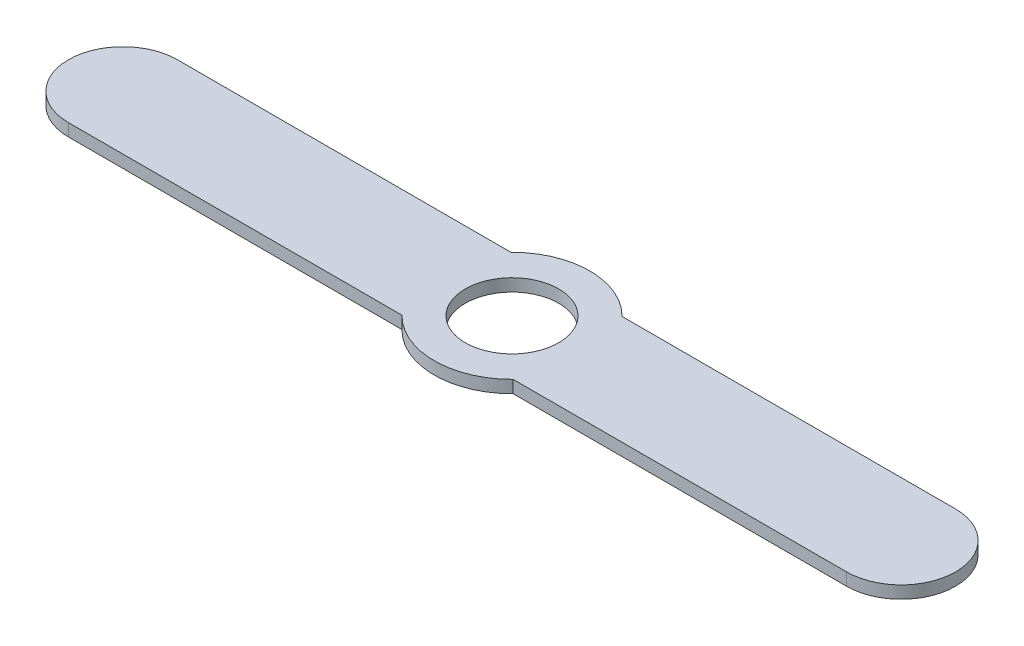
ISO-10303-21;
HEADER;
FILE_DESCRIPTION(('STEP AP214'),'2;1');
FILE_NAME('part.step','',(''),(''),'','','');
FILE_SCHEMA(('AUTOMOTIVE_DESIGN { 1 0 10303 214 1 1 1 1 }'));
ENDSEC;
DATA;
#1=APPLICATION_CONTEXT('core data for automotive mechanical design processes');
#2=APPLICATION_PROTOCOL_DEFINITION('international standard','automotive_design',2000,#1);
#3=PRODUCT_CONTEXT('',#1,'mechanical');
#4=PRODUCT('Part','Part','',(#3));
#5=PRODUCT_RELATED_PRODUCT_CATEGORY('part','',(#4));
#6=PRODUCT_DEFINITION_FORMATION('','',#4);
#7=PRODUCT_DEFINITION_CONTEXT('part definition',#1,'design');
#8=PRODUCT_DEFINITION('design','',#6,#7);
#9=PRODUCT_DEFINITION_SHAPE('','',#8);
#10=(LENGTH_UNIT() NAMED_UNIT(*) SI_UNIT(.MILLI.,.METRE.));
#11=(NAMED_UNIT(*) PLANE_ANGLE_UNIT() SI_UNIT($,.RADIAN.));
#12=(NAMED_UNIT(*) SI_UNIT($,.STERADIAN.) SOLID_ANGLE_UNIT());
#13=UNCERTAINTY_MEASURE_WITH_UNIT(LENGTH_MEASURE(1.E-05),#10,'distance_accuracy_value','');
#14=(GEOMETRIC_REPRESENTATION_CONTEXT(3) GLOBAL_UNCERTAINTY_ASSIGNED_CONTEXT((#13)) GLOBAL_UNIT_ASSIGNED_CONTEXT((#10,
#11,#12)) REPRESENTATION_CONTEXT('',''));
#15=CARTESIAN_POINT('',(0.,0.,0.));
#16=DIRECTION('',(0.,0.,1.));
#17=DIRECTION('',(1.,0.,0.));
#18=AXIS2_PLACEMENT_3D('',#15,#16,#17);
#19=CARTESIAN_POINT('',(0.,0.254,0.));
#20=DIRECTION('',(0.,1.,0.));
#21=DIRECTION('',(0.,0.,1.));
#22=AXIS2_PLACEMENT_3D('',#19,#20,#21);
#23=PLANE('',#22);
#24=CARTESIAN_POINT('',(0.,0.254,0.));
#25=DIRECTION('',(0.,1.,0.));
#26=DIRECTION('',(0.,0.,1.));
#27=AXIS2_PLACEMENT_3D('',#24,#25,#26);
#28=CIRCLE('',#27,1.905);
#29=CARTESIAN_POINT('',(0.,0.254,1.905));
#30=VERTEX_POINT('',#29);
#31=EDGE_CURVE('E155',#30,#30,#28,.T.);
#32=ORIENTED_EDGE('',*,*,#31,.T.);
#33=EDGE_LOOP('',(#32));
#34=FACE_BOUND('',#33,.T.);
#35=CARTESIAN_POINT('',(0.,0.254,0.));
#36=DIRECTION('',(0.,1.,0.));
#37=DIRECTION('',(0.,0.,1.));
#38=AXIS2_PLACEMENT_3D('',#35,#36,#37);
#39=CIRCLE('',#38,3.175);
#40=CARTESIAN_POINT('',(-2.26740352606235,0.254,2.2225));
#41=VERTEX_POINT('',#40);
#42=CARTESIAN_POINT('',(2.26740352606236,0.254,2.2225));
#43=VERTEX_POINT('',#42);
#44=EDGE_CURVE('E178',#41,#43,#39,.T.);
#45=ORIENTED_EDGE('',*,*,#44,.F.);
#46=DIRECTION('',(1.,0.,0.));
#47=VECTOR('',#46,1.);
#48=CARTESIAN_POINT('',(0.,0.254,2.2225));
#49=LINE('',#48,#47);
#50=CARTESIAN_POINT('',(-15.875,0.254,2.2225));
#51=VERTEX_POINT('',#50);
#52=EDGE_CURVE('E176',#51,#41,#49,.T.);
#53=ORIENTED_EDGE('',*,*,#52,.F.);
#54=CARTESIAN_POINT('',(-15.875,0.254,0.));
#55=DIRECTION('',(0.,1.,0.));
#56=DIRECTION('',(0.,0.,1.));
#57=AXIS2_PLACEMENT_3D('',#54,#55,#56);
#58=CIRCLE('',#57,2.2225);
#59=CARTESIAN_POINT('',(-15.875,0.254,-2.2225));
#60=VERTEX_POINT('',#59);
#61=EDGE_CURVE('E146',#60,#51,#58,.T.);
#62=ORIENTED_EDGE('',*,*,#61,.F.);
#63=DIRECTION('',(1.,0.,0.));
#64=VECTOR('',#63,1.);
#65=CARTESIAN_POINT('',(0.,0.254,-2.2225));
#66=LINE('',#65,#64);
#67=CARTESIAN_POINT('',(-2.26740352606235,0.254,-2.2225));
#68=VERTEX_POINT('',#67);
#69=EDGE_CURVE('E142',#60,#68,#66,.T.);
#70=ORIENTED_EDGE('',*,*,#69,.T.);
#71=CARTESIAN_POINT('',(0.,0.254,0.));
#72=DIRECTION('',(0.,1.,0.));
#73=DIRECTION('',(0.,0.,1.));
#74=AXIS2_PLACEMENT_3D('',#71,#72,#73);
#75=CIRCLE('',#74,3.175);
#76=CARTESIAN_POINT('',(2.26740352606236,0.254,-2.2225));
#77=VERTEX_POINT('',#76);
#78=EDGE_CURVE('E154',#77,#68,#75,.T.);
#79=ORIENTED_EDGE('',*,*,#78,.F.);
#80=CARTESIAN_POINT('',(15.875,0.254,-2.2225));
#81=VERTEX_POINT('',#80);
#82=EDGE_CURVE('E186',#77,#81,#66,.T.);
#83=ORIENTED_EDGE('',*,*,#82,.T.);
#84=CARTESIAN_POINT('',(15.875,0.254,0.));
#85=DIRECTION('',(0.,1.,0.));
#86=DIRECTION('',(0.,0.,1.));
#87=AXIS2_PLACEMENT_3D('',#84,#85,#86);
#88=CIRCLE('',#87,2.2225);
#89=CARTESIAN_POINT('',(15.875,0.254,2.2225));
#90=VERTEX_POINT('',#89);
#91=EDGE_CURVE('E183',#90,#81,#88,.T.);
#92=ORIENTED_EDGE('',*,*,#91,.F.);
#93=DIRECTION('',(1.,0.,0.));
#94=VECTOR('',#93,1.);
#95=CARTESIAN_POINT('',(0.,0.254,2.2225));
#96=LINE('',#95,#94);
#97=EDGE_CURVE('E181',#43,#90,#96,.T.);
#98=ORIENTED_EDGE('',*,*,#97,.F.);
#99=EDGE_LOOP('',(#45,#53,#62,#70,#79,#83,#92,#98));
#100=FACE_BOUND('',#99,.T.);
#101=ADVANCED_FACE('F59',(#34,#100),#23,.F.);
#102=CARTESIAN_POINT('',(0.,0.762,0.));
#103=DIRECTION('',(0.,-1.,0.));
#104=DIRECTION('',(0.,0.,-1.));
#105=AXIS2_PLACEMENT_3D('',#102,#103,#104);
#106=CYLINDRICAL_SURFACE('',#105,3.175);
#107=ORIENTED_EDGE('',*,*,#44,.T.);
#108=DIRECTION('',(0.,-1.,0.));
#109=VECTOR('',#108,1.);
#110=CARTESIAN_POINT('',(2.26740352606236,0.762,2.2225));
#111=LINE('',#110,#109);
#112=CARTESIAN_POINT('',(2.26740352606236,0.762,2.2225));
#113=VERTEX_POINT('',#112);
#114=EDGE_CURVE('E148',#113,#43,#111,.T.);
#115=ORIENTED_EDGE('',*,*,#114,.F.);
#116=CARTESIAN_POINT('',(0.,0.762,0.));
#117=DIRECTION('',(0.,1.,0.));
#118=DIRECTION('',(0.,0.,1.));
#119=AXIS2_PLACEMENT_3D('',#116,#117,#118);
#120=CIRCLE('',#119,3.175);
#121=CARTESIAN_POINT('',(-2.26740352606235,0.762,2.2225));
#122=VERTEX_POINT('',#121);
#123=EDGE_CURVE('E132',#122,#113,#120,.T.);
#124=ORIENTED_EDGE('',*,*,#123,.F.);
#125=DIRECTION('',(0.,-1.,0.));
#126=VECTOR('',#125,1.);
#127=CARTESIAN_POINT('',(-2.26740352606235,0.762,2.2225));
#128=LINE('',#127,#126);
#129=EDGE_CURVE('E128',#122,#41,#128,.T.);
#130=ORIENTED_EDGE('',*,*,#129,.T.);
#131=EDGE_LOOP('',(#107,#115,#124,#130));
#132=FACE_BOUND('',#131,.T.);
#133=ADVANCED_FACE('F201',(#132),#106,.T.);
#134=CARTESIAN_POINT('',(0.,0.762,0.));
#135=DIRECTION('',(0.,1.,0.));
#136=DIRECTION('',(0.,0.,1.));
#137=AXIS2_PLACEMENT_3D('',#134,#135,#136);
#138=PLANE('',#137);
#139=CARTESIAN_POINT('',(0.,0.762,0.));
#140=DIRECTION('',(0.,1.,0.));
#141=DIRECTION('',(0.,0.,1.));
#142=AXIS2_PLACEMENT_3D('',#139,#140,#141);
#143=CIRCLE('',#142,1.905);
#144=CARTESIAN_POINT('',(0.,0.762,1.905));
#145=VERTEX_POINT('',#144);
#146=EDGE_CURVE('E159',#145,#145,#143,.T.);
#147=ORIENTED_EDGE('',*,*,#146,.F.);
#148=EDGE_LOOP('',(#147));
#149=FACE_BOUND('',#148,.T.);
#150=DIRECTION('',(1.,0.,0.));
#151=VECTOR('',#150,1.);
#152=CARTESIAN_POINT('',(0.,0.762,-2.2225));
#153=LINE('',#152,#151);
#154=CARTESIAN_POINT('',(2.26740352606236,0.762,-2.2225));
#155=VERTEX_POINT('',#154);
#156=CARTESIAN_POINT('',(15.875,0.762,-2.2225));
#157=VERTEX_POINT('',#156);
#158=EDGE_CURVE('E172',#155,#157,#153,.T.);
#159=ORIENTED_EDGE('',*,*,#158,.F.);
#160=CARTESIAN_POINT('',(0.,0.762,0.));
#161=DIRECTION('',(0.,1.,0.));
#162=DIRECTION('',(0.,0.,1.));
#163=AXIS2_PLACEMENT_3D('',#160,#161,#162);
#164=CIRCLE('',#163,3.175);
#165=CARTESIAN_POINT('',(-2.26740352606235,0.762,-2.2225));
#166=VERTEX_POINT('',#165);
#167=EDGE_CURVE('E152',#155,#166,#164,.T.);
#168=ORIENTED_EDGE('',*,*,#167,.T.);
#169=CARTESIAN_POINT('',(-15.875,0.762,-2.2225));
#170=VERTEX_POINT('',#169);
#171=EDGE_CURVE('E140',#170,#166,#153,.T.);
#172=ORIENTED_EDGE('',*,*,#171,.F.);
#173=CARTESIAN_POINT('',(-15.875,0.762,0.));
#174=DIRECTION('',(0.,1.,0.));
#175=DIRECTION('',(0.,0.,1.));
#176=AXIS2_PLACEMENT_3D('',#173,#174,#175);
#177=CIRCLE('',#176,2.2225);
#178=CARTESIAN_POINT('',(-15.875,0.762,2.2225));
#179=VERTEX_POINT('',#178);
#180=EDGE_CURVE('E133',#170,#179,#177,.T.);
#181=ORIENTED_EDGE('',*,*,#180,.T.);
#182=DIRECTION('',(1.,0.,0.));
#183=VECTOR('',#182,1.);
#184=CARTESIAN_POINT('',(0.,0.762,2.2225));
#185=LINE('',#184,#183);
#186=EDGE_CURVE('E121',#179,#122,#185,.T.);
#187=ORIENTED_EDGE('',*,*,#186,.T.);
#188=ORIENTED_EDGE('',*,*,#123,.T.);
#189=DIRECTION('',(1.,0.,0.));
#190=VECTOR('',#189,1.);
#191=CARTESIAN_POINT('',(0.,0.762,2.2225));
#192=LINE('',#191,#190);
#193=CARTESIAN_POINT('',(15.875,0.762,2.2225));
#194=VERTEX_POINT('',#193);
#195=EDGE_CURVE('E167',#113,#194,#192,.T.);
#196=ORIENTED_EDGE('',*,*,#195,.T.);
#197=CARTESIAN_POINT('',(15.875,0.762,0.));
#198=DIRECTION('',(0.,1.,0.));
#199=DIRECTION('',(0.,0.,1.));
#200=AXIS2_PLACEMENT_3D('',#197,#198,#199);
#201=CIRCLE('',#200,2.2225);
#202=EDGE_CURVE('E169',#194,#157,#201,.T.);
#203=ORIENTED_EDGE('',*,*,#202,.T.);
#204=EDGE_LOOP('',(#159,#168,#172,#181,#187,#188,#196,#203));
#205=FACE_BOUND('',#204,.T.);
#206=ADVANCED_FACE('F138',(#149,#205),#138,.T.);
#207=CARTESIAN_POINT('',(0.,0.762,2.2225));
#208=DIRECTION('',(0.,0.,-1.));
#209=DIRECTION('',(-1.,0.,0.));
#210=AXIS2_PLACEMENT_3D('',#207,#208,#209);
#211=PLANE('',#210);
#212=ORIENTED_EDGE('',*,*,#97,.T.);
#213=DIRECTION('',(0.,-1.,0.));
#214=VECTOR('',#213,1.);
#215=CARTESIAN_POINT('',(15.875,0.762,2.2225));
#216=LINE('',#215,#214);
#217=EDGE_CURVE('E192',#194,#90,#216,.T.);
#218=ORIENTED_EDGE('',*,*,#217,.F.);
#219=ORIENTED_EDGE('',*,*,#195,.F.);
#220=ORIENTED_EDGE('',*,*,#114,.T.);
#221=EDGE_LOOP('',(#212,#218,#219,#220));
#222=FACE_BOUND('',#221,.T.);
#223=ADVANCED_FACE('F196',(#222),#211,.F.);
#224=CARTESIAN_POINT('',(15.875,0.762,0.));
#225=DIRECTION('',(0.,-1.,0.));
#226=DIRECTION('',(0.,0.,-1.));
#227=AXIS2_PLACEMENT_3D('',#224,#225,#226);
#228=CYLINDRICAL_SURFACE('',#227,2.2225);
#229=ORIENTED_EDGE('',*,*,#91,.T.);
#230=DIRECTION('',(0.,-1.,0.));
#231=VECTOR('',#230,1.);
#232=CARTESIAN_POINT('',(15.875,0.762,-2.2225));
#233=LINE('',#232,#231);
#234=EDGE_CURVE('E189',#157,#81,#233,.T.);
#235=ORIENTED_EDGE('',*,*,#234,.F.);
#236=ORIENTED_EDGE('',*,*,#202,.F.);
#237=ORIENTED_EDGE('',*,*,#217,.T.);
#238=EDGE_LOOP('',(#229,#235,#236,#237));
#239=FACE_BOUND('',#238,.T.);
#240=ADVANCED_FACE('F206',(#239),#228,.T.);
#241=CARTESIAN_POINT('',(0.,0.762,-2.2225));
#242=DIRECTION('',(0.,0.,-1.));
#243=DIRECTION('',(-1.,0.,0.));
#244=AXIS2_PLACEMENT_3D('',#241,#242,#243);
#245=PLANE('',#244);
#246=ORIENTED_EDGE('',*,*,#82,.F.);
#247=DIRECTION('',(0.,-1.,0.));
#248=VECTOR('',#247,1.);
#249=CARTESIAN_POINT('',(2.26740352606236,0.762,-2.2225));
#250=LINE('',#249,#248);
#251=EDGE_CURVE('E12',#77,#155,#250,.F.);
#252=ORIENTED_EDGE('',*,*,#251,.T.);
#253=ORIENTED_EDGE('',*,*,#158,.T.);
#254=ORIENTED_EDGE('',*,*,#234,.T.);
#255=EDGE_LOOP('',(#246,#252,#253,#254));
#256=FACE_BOUND('',#255,.T.);
#257=ADVANCED_FACE('F208',(#256),#245,.T.);
#258=ORIENTED_EDGE('',*,*,#171,.T.);
#259=DIRECTION('',(0.,-1.,0.));
#260=VECTOR('',#259,1.);
#261=CARTESIAN_POINT('',(-2.26740352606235,0.762,-2.2225));
#262=LINE('',#261,#260);
#263=EDGE_CURVE('E67',#166,#68,#262,.T.);
#264=ORIENTED_EDGE('',*,*,#263,.T.);
#265=ORIENTED_EDGE('',*,*,#69,.F.);
#266=DIRECTION('',(0.,-1.,0.));
#267=VECTOR('',#266,1.);
#268=CARTESIAN_POINT('',(-15.875,0.762,-2.2225));
#269=LINE('',#268,#267);
#270=EDGE_CURVE('E174',#170,#60,#269,.T.);
#271=ORIENTED_EDGE('',*,*,#270,.F.);
#272=EDGE_LOOP('',(#258,#264,#265,#271));
#273=FACE_BOUND('',#272,.T.);
#274=ADVANCED_FACE('F210',(#273),#245,.T.);
#275=CARTESIAN_POINT('',(-15.875,0.762,0.));
#276=DIRECTION('',(0.,-1.,0.));
#277=DIRECTION('',(0.,0.,-1.));
#278=AXIS2_PLACEMENT_3D('',#275,#276,#277);
#279=CYLINDRICAL_SURFACE('',#278,2.2225);
#280=ORIENTED_EDGE('',*,*,#61,.T.);
#281=DIRECTION('',(0.,-1.,0.));
#282=VECTOR('',#281,1.);
#283=CARTESIAN_POINT('',(-15.875,0.762,2.2225));
#284=LINE('',#283,#282);
#285=EDGE_CURVE('E126',#179,#51,#284,.T.);
#286=ORIENTED_EDGE('',*,*,#285,.F.);
#287=ORIENTED_EDGE('',*,*,#180,.F.);
#288=ORIENTED_EDGE('',*,*,#270,.T.);
#289=EDGE_LOOP('',(#280,#286,#287,#288));
#290=FACE_BOUND('',#289,.T.);
#291=ADVANCED_FACE('F144',(#290),#279,.T.);
#292=CARTESIAN_POINT('',(0.,0.762,2.2225));
#293=DIRECTION('',(0.,0.,-1.));
#294=DIRECTION('',(-1.,0.,0.));
#295=AXIS2_PLACEMENT_3D('',#292,#293,#294);
#296=PLANE('',#295);
#297=ORIENTED_EDGE('',*,*,#52,.T.);
#298=ORIENTED_EDGE('',*,*,#129,.F.);
#299=ORIENTED_EDGE('',*,*,#186,.F.);
#300=ORIENTED_EDGE('',*,*,#285,.T.);
#301=EDGE_LOOP('',(#297,#298,#299,#300));
#302=FACE_BOUND('',#301,.T.);
#303=ADVANCED_FACE('F124',(#302),#296,.F.);
#304=CARTESIAN_POINT('',(0.,0.762,0.));
#305=DIRECTION('',(0.,-1.,0.));
#306=DIRECTION('',(0.,0.,-1.));
#307=AXIS2_PLACEMENT_3D('',#304,#305,#306);
#308=CYLINDRICAL_SURFACE('',#307,3.175);
#309=ORIENTED_EDGE('',*,*,#251,.F.);
#310=ORIENTED_EDGE('',*,*,#78,.T.);
#311=ORIENTED_EDGE('',*,*,#263,.F.);
#312=ORIENTED_EDGE('',*,*,#167,.F.);
#313=EDGE_LOOP('',(#309,#310,#311,#312));
#314=FACE_BOUND('',#313,.T.);
#315=ADVANCED_FACE('F61',(#314),#308,.T.);
#316=CARTESIAN_POINT('',(0.,0.254,0.));
#317=DIRECTION('',(0.,1.,0.));
#318=DIRECTION('',(0.,0.,1.));
#319=AXIS2_PLACEMENT_3D('',#316,#317,#318);
#320=CYLINDRICAL_SURFACE('',#319,1.905);
#321=ORIENTED_EDGE('',*,*,#31,.F.);
#322=EDGE_LOOP('',(#321));
#323=FACE_BOUND('',#322,.T.);
#324=ORIENTED_EDGE('',*,*,#146,.T.);
#325=EDGE_LOOP('',(#324));
#326=FACE_BOUND('',#325,.T.);
#327=ADVANCED_FACE('F245',(#323,#326),#320,.F.);
#328=CLOSED_SHELL('',(#101,#133,#206,#223,#240,#257,#274,#291,#303,#315,#327));
#329=MANIFOLD_SOLID_BREP('B2',#328);
#330=ADVANCED_BREP_SHAPE_REPRESENTATION('',(#18,#329),#14);
#331=SHAPE_DEFINITION_REPRESENTATION(#9,#330);
ENDSEC;
END-ISO-10303-21;
